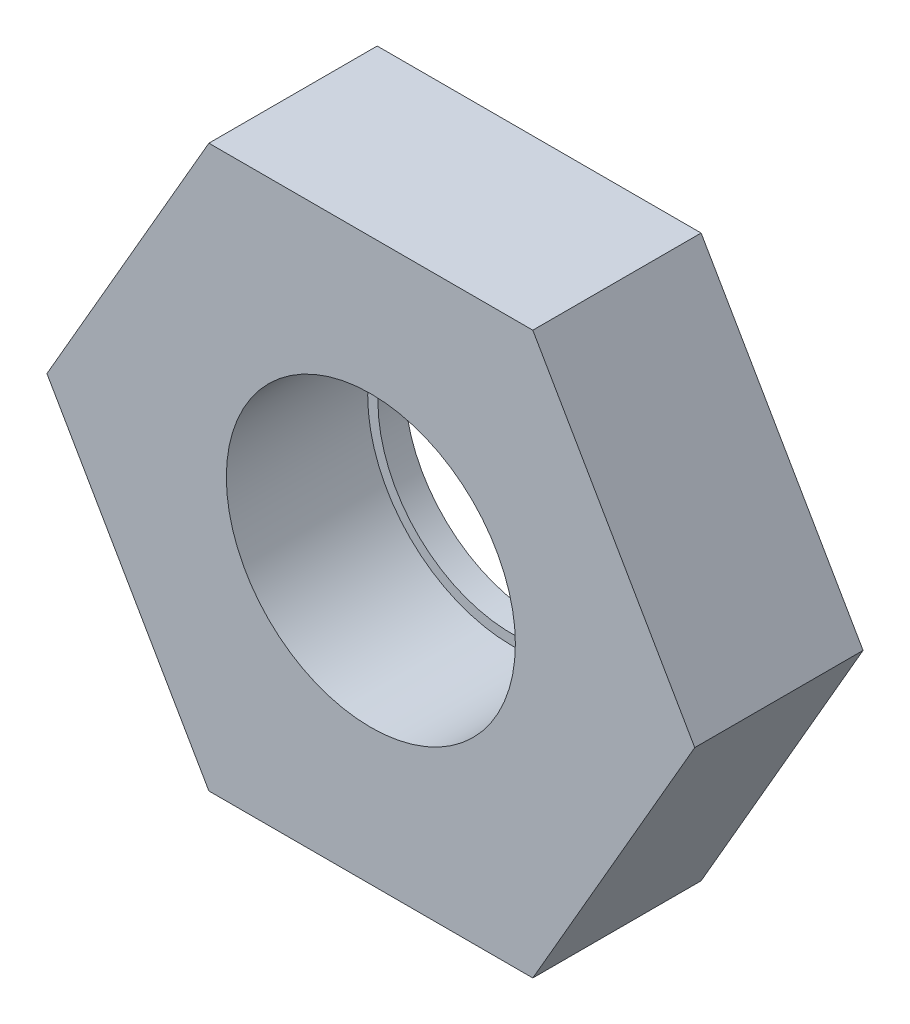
ISO-10303-21;
HEADER;
FILE_DESCRIPTION(('STEP AP214'),'2;1');
FILE_NAME('part.step','',(''),(''),'','','');
FILE_SCHEMA(('AUTOMOTIVE_DESIGN { 1 0 10303 214 1 1 1 1 }'));
ENDSEC;
DATA;
#1=APPLICATION_CONTEXT('core data for automotive mechanical design processes');
#2=APPLICATION_PROTOCOL_DEFINITION('international standard','automotive_design',2000,#1);
#3=PRODUCT_CONTEXT('',#1,'mechanical');
#4=PRODUCT('Part','Part','',(#3));
#5=PRODUCT_RELATED_PRODUCT_CATEGORY('part','',(#4));
#6=PRODUCT_DEFINITION_FORMATION('','',#4);
#7=PRODUCT_DEFINITION_CONTEXT('part definition',#1,'design');
#8=PRODUCT_DEFINITION('design','',#6,#7);
#9=PRODUCT_DEFINITION_SHAPE('','',#8);
#10=(LENGTH_UNIT() NAMED_UNIT(*) SI_UNIT(.MILLI.,.METRE.));
#11=(NAMED_UNIT(*) PLANE_ANGLE_UNIT() SI_UNIT($,.RADIAN.));
#12=(NAMED_UNIT(*) SI_UNIT($,.STERADIAN.) SOLID_ANGLE_UNIT());
#13=UNCERTAINTY_MEASURE_WITH_UNIT(LENGTH_MEASURE(1.E-05),#10,'distance_accuracy_value','');
#14=(GEOMETRIC_REPRESENTATION_CONTEXT(3) GLOBAL_UNCERTAINTY_ASSIGNED_CONTEXT((#13)) GLOBAL_UNIT_ASSIGNED_CONTEXT((#10,
#11,#12)) REPRESENTATION_CONTEXT('',''));
#15=CARTESIAN_POINT('',(0.,0.,0.));
#16=DIRECTION('',(0.,0.,1.));
#17=DIRECTION('',(1.,0.,0.));
#18=AXIS2_PLACEMENT_3D('',#15,#16,#17);
#19=CARTESIAN_POINT('',(13.748153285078,7.9375,4.7625));
#20=DIRECTION('',(0.,0.,1.));
#21=DIRECTION('',(1.,0.,0.));
#22=AXIS2_PLACEMENT_3D('',#19,#20,#21);
#23=PLANE('',#22);
#24=DIRECTION('',(0.5,0.86602540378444,0.));
#25=VECTOR('',#24,1.);
#26=CARTESIAN_POINT('',(4.58271776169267,-7.9375,4.7625));
#27=LINE('',#26,#25);
#28=CARTESIAN_POINT('',(4.58271776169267,-7.9375,4.7625));
#29=VERTEX_POINT('',#28);
#30=CARTESIAN_POINT('',(9.16543552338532,0.,4.7625));
#31=VERTEX_POINT('',#30);
#32=EDGE_CURVE('E100',#29,#31,#27,.T.);
#33=ORIENTED_EDGE('',*,*,#32,.T.);
#34=DIRECTION('',(-0.5,0.86602540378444,0.));
#35=VECTOR('',#34,1.);
#36=CARTESIAN_POINT('',(9.16543552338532,0.,4.7625));
#37=LINE('',#36,#35);
#38=CARTESIAN_POINT('',(4.58271776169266,7.9375,4.7625));
#39=VERTEX_POINT('',#38);
#40=EDGE_CURVE('E82',#31,#39,#37,.T.);
#41=ORIENTED_EDGE('',*,*,#40,.T.);
#42=DIRECTION('',(-1.,0.,0.));
#43=VECTOR('',#42,1.);
#44=CARTESIAN_POINT('',(4.58271776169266,7.9375,4.7625));
#45=LINE('',#44,#43);
#46=CARTESIAN_POINT('',(-4.58271776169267,7.9375,4.7625));
#47=VERTEX_POINT('',#46);
#48=EDGE_CURVE('E103',#39,#47,#45,.T.);
#49=ORIENTED_EDGE('',*,*,#48,.T.);
#50=DIRECTION('',(-0.5,-0.86602540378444,0.));
#51=VECTOR('',#50,1.);
#52=CARTESIAN_POINT('',(-4.58271776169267,7.9375,4.7625));
#53=LINE('',#52,#51);
#54=CARTESIAN_POINT('',(-9.16543552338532,0.,4.7625));
#55=VERTEX_POINT('',#54);
#56=EDGE_CURVE('E105',#47,#55,#53,.T.);
#57=ORIENTED_EDGE('',*,*,#56,.T.);
#58=DIRECTION('',(0.5,-0.86602540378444,0.));
#59=VECTOR('',#58,1.);
#60=CARTESIAN_POINT('',(-9.16543552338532,0.,4.7625));
#61=LINE('',#60,#59);
#62=CARTESIAN_POINT('',(-4.58271776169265,-7.9375,4.7625));
#63=VERTEX_POINT('',#62);
#64=EDGE_CURVE('E35',#55,#63,#61,.T.);
#65=ORIENTED_EDGE('',*,*,#64,.T.);
#66=DIRECTION('',(1.,0.,0.));
#67=VECTOR('',#66,1.);
#68=CARTESIAN_POINT('',(-4.58271776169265,-7.9375,4.7625));
#69=LINE('',#68,#67);
#70=EDGE_CURVE('E30',#63,#29,#69,.T.);
#71=ORIENTED_EDGE('',*,*,#70,.T.);
#72=EDGE_LOOP('',(#33,#41,#49,#57,#65,#71));
#73=FACE_BOUND('',#72,.T.);
#74=CARTESIAN_POINT('',(0.,0.,4.7625));
#75=DIRECTION('',(0.,0.,1.));
#76=DIRECTION('',(1.,0.,0.));
#77=AXIS2_PLACEMENT_3D('',#74,#75,#76);
#78=CIRCLE('',#77,4.0894);
#79=CARTESIAN_POINT('',(4.0894,0.,4.7625));
#80=VERTEX_POINT('',#79);
#81=EDGE_CURVE('E18',#80,#80,#78,.F.);
#82=ORIENTED_EDGE('',*,*,#81,.T.);
#83=EDGE_LOOP('',(#82));
#84=FACE_BOUND('',#83,.T.);
#85=ADVANCED_FACE('F14',(#73,#84),#23,.T.);
#86=CARTESIAN_POINT('',(13.748153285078,7.9375,0.));
#87=DIRECTION('',(0.,0.,1.));
#88=DIRECTION('',(1.,0.,0.));
#89=AXIS2_PLACEMENT_3D('',#86,#87,#88);
#90=PLANE('',#89);
#91=DIRECTION('',(0.5,0.86602540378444,0.));
#92=VECTOR('',#91,1.);
#93=CARTESIAN_POINT('',(4.58271776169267,-7.9375,0.));
#94=LINE('',#93,#92);
#95=CARTESIAN_POINT('',(4.58271776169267,-7.9375,0.));
#96=VERTEX_POINT('',#95);
#97=CARTESIAN_POINT('',(9.16543552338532,0.,0.));
#98=VERTEX_POINT('',#97);
#99=EDGE_CURVE('E73',#96,#98,#94,.T.);
#100=ORIENTED_EDGE('',*,*,#99,.F.);
#101=DIRECTION('',(1.,0.,0.));
#102=VECTOR('',#101,1.);
#103=CARTESIAN_POINT('',(-4.58271776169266,-7.9375,0.));
#104=LINE('',#103,#102);
#105=CARTESIAN_POINT('',(-4.58271776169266,-7.9375,0.));
#106=VERTEX_POINT('',#105);
#107=EDGE_CURVE('E98',#106,#96,#104,.T.);
#108=ORIENTED_EDGE('',*,*,#107,.F.);
#109=DIRECTION('',(0.5,-0.86602540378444,0.));
#110=VECTOR('',#109,1.);
#111=CARTESIAN_POINT('',(-9.16543552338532,0.,0.));
#112=LINE('',#111,#110);
#113=CARTESIAN_POINT('',(-9.16543552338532,0.,0.));
#114=VERTEX_POINT('',#113);
#115=EDGE_CURVE('E96',#114,#106,#112,.T.);
#116=ORIENTED_EDGE('',*,*,#115,.F.);
#117=DIRECTION('',(-0.5,-0.86602540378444,0.));
#118=VECTOR('',#117,1.);
#119=CARTESIAN_POINT('',(-4.58271776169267,7.9375,0.));
#120=LINE('',#119,#118);
#121=CARTESIAN_POINT('',(-4.58271776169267,7.9375,0.));
#122=VERTEX_POINT('',#121);
#123=EDGE_CURVE('E94',#122,#114,#120,.T.);
#124=ORIENTED_EDGE('',*,*,#123,.F.);
#125=DIRECTION('',(-1.,0.,0.));
#126=VECTOR('',#125,1.);
#127=CARTESIAN_POINT('',(4.58271776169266,7.9375,0.));
#128=LINE('',#127,#126);
#129=CARTESIAN_POINT('',(4.58271776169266,7.9375,0.));
#130=VERTEX_POINT('',#129);
#131=EDGE_CURVE('E75',#130,#122,#128,.T.);
#132=ORIENTED_EDGE('',*,*,#131,.F.);
#133=DIRECTION('',(-0.5,0.86602540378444,0.));
#134=VECTOR('',#133,1.);
#135=CARTESIAN_POINT('',(9.16543552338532,0.,0.));
#136=LINE('',#135,#134);
#137=EDGE_CURVE('E68',#98,#130,#136,.T.);
#138=ORIENTED_EDGE('',*,*,#137,.F.);
#139=EDGE_LOOP('',(#100,#108,#116,#124,#132,#138));
#140=FACE_BOUND('',#139,.T.);
#141=CARTESIAN_POINT('',(0.,0.,0.));
#142=DIRECTION('',(0.,0.,1.));
#143=DIRECTION('',(1.,0.,0.));
#144=AXIS2_PLACEMENT_3D('',#141,#142,#143);
#145=CIRCLE('',#144,3.8);
#146=CARTESIAN_POINT('',(3.8,0.,0.));
#147=VERTEX_POINT('',#146);
#148=EDGE_CURVE('E163',#147,#147,#145,.F.);
#149=ORIENTED_EDGE('',*,*,#148,.F.);
#150=EDGE_LOOP('',(#149));
#151=FACE_BOUND('',#150,.T.);
#152=ADVANCED_FACE('F69',(#140,#151),#90,.F.);
#153=CARTESIAN_POINT('',(4.58271776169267,-7.9375,4.7625));
#154=DIRECTION('',(-0.86602540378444,0.5,0.));
#155=DIRECTION('',(-0.5,-0.86602540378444,0.));
#156=AXIS2_PLACEMENT_3D('',#153,#154,#155);
#157=PLANE('',#156);
#158=ORIENTED_EDGE('',*,*,#99,.T.);
#159=DIRECTION('',(0.,0.,-1.));
#160=VECTOR('',#159,1.);
#161=CARTESIAN_POINT('',(9.16543552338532,0.,4.7625));
#162=LINE('',#161,#160);
#163=EDGE_CURVE('E9',#31,#98,#162,.T.);
#164=ORIENTED_EDGE('',*,*,#163,.F.);
#165=ORIENTED_EDGE('',*,*,#32,.F.);
#166=DIRECTION('',(0.,0.,-1.));
#167=VECTOR('',#166,1.);
#168=CARTESIAN_POINT('',(4.58271776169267,-7.9375,4.7625));
#169=LINE('',#168,#167);
#170=EDGE_CURVE('E86',#29,#96,#169,.T.);
#171=ORIENTED_EDGE('',*,*,#170,.T.);
#172=EDGE_LOOP('',(#158,#164,#165,#171));
#173=FACE_BOUND('',#172,.T.);
#174=ADVANCED_FACE('F16',(#173),#157,.F.);
#175=CARTESIAN_POINT('',(9.16543552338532,0.,4.7625));
#176=DIRECTION('',(-0.86602540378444,-0.5,0.));
#177=DIRECTION('',(0.5,-0.86602540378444,0.));
#178=AXIS2_PLACEMENT_3D('',#175,#176,#177);
#179=PLANE('',#178);
#180=ORIENTED_EDGE('',*,*,#137,.T.);
#181=DIRECTION('',(0.,0.,-1.));
#182=VECTOR('',#181,1.);
#183=CARTESIAN_POINT('',(4.58271776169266,7.9375,4.7625));
#184=LINE('',#183,#182);
#185=EDGE_CURVE('E23',#39,#130,#184,.T.);
#186=ORIENTED_EDGE('',*,*,#185,.F.);
#187=ORIENTED_EDGE('',*,*,#40,.F.);
#188=ORIENTED_EDGE('',*,*,#163,.T.);
#189=EDGE_LOOP('',(#180,#186,#187,#188));
#190=FACE_BOUND('',#189,.T.);
#191=ADVANCED_FACE('F81',(#190),#179,.F.);
#192=CARTESIAN_POINT('',(4.58271776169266,7.9375,4.7625));
#193=DIRECTION('',(0.,-1.,0.));
#194=DIRECTION('',(0.,0.,-1.));
#195=AXIS2_PLACEMENT_3D('',#192,#193,#194);
#196=PLANE('',#195);
#197=ORIENTED_EDGE('',*,*,#131,.T.);
#198=DIRECTION('',(0.,0.,-1.));
#199=VECTOR('',#198,1.);
#200=CARTESIAN_POINT('',(-4.58271776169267,7.9375,4.7625));
#201=LINE('',#200,#199);
#202=EDGE_CURVE('E116',#47,#122,#201,.T.);
#203=ORIENTED_EDGE('',*,*,#202,.F.);
#204=ORIENTED_EDGE('',*,*,#48,.F.);
#205=ORIENTED_EDGE('',*,*,#185,.T.);
#206=EDGE_LOOP('',(#197,#203,#204,#205));
#207=FACE_BOUND('',#206,.T.);
#208=ADVANCED_FACE('F121',(#207),#196,.F.);
#209=CARTESIAN_POINT('',(-4.58271776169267,7.9375,4.7625));
#210=DIRECTION('',(0.86602540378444,-0.5,0.));
#211=DIRECTION('',(0.5,0.86602540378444,0.));
#212=AXIS2_PLACEMENT_3D('',#209,#210,#211);
#213=PLANE('',#212);
#214=ORIENTED_EDGE('',*,*,#123,.T.);
#215=DIRECTION('',(0.,0.,-1.));
#216=VECTOR('',#215,1.);
#217=CARTESIAN_POINT('',(-9.16543552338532,0.,4.7625));
#218=LINE('',#217,#216);
#219=EDGE_CURVE('E113',#55,#114,#218,.T.);
#220=ORIENTED_EDGE('',*,*,#219,.F.);
#221=ORIENTED_EDGE('',*,*,#56,.F.);
#222=ORIENTED_EDGE('',*,*,#202,.T.);
#223=EDGE_LOOP('',(#214,#220,#221,#222));
#224=FACE_BOUND('',#223,.T.);
#225=ADVANCED_FACE('F127',(#224),#213,.F.);
#226=CARTESIAN_POINT('',(-9.16543552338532,0.,4.7625));
#227=DIRECTION('',(0.86602540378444,0.5,0.));
#228=DIRECTION('',(-0.5,0.86602540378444,0.));
#229=AXIS2_PLACEMENT_3D('',#226,#227,#228);
#230=PLANE('',#229);
#231=ORIENTED_EDGE('',*,*,#115,.T.);
#232=DIRECTION('',(0.,0.,-1.));
#233=VECTOR('',#232,1.);
#234=CARTESIAN_POINT('',(-4.58271776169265,-7.9375,4.7625));
#235=LINE('',#234,#233);
#236=EDGE_CURVE('E110',#63,#106,#235,.T.);
#237=ORIENTED_EDGE('',*,*,#236,.F.);
#238=ORIENTED_EDGE('',*,*,#64,.F.);
#239=ORIENTED_EDGE('',*,*,#219,.T.);
#240=EDGE_LOOP('',(#231,#237,#238,#239));
#241=FACE_BOUND('',#240,.T.);
#242=ADVANCED_FACE('F130',(#241),#230,.F.);
#243=CARTESIAN_POINT('',(-4.58271776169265,-7.9375,4.7625));
#244=DIRECTION('',(0.,1.,0.));
#245=DIRECTION('',(0.,0.,1.));
#246=AXIS2_PLACEMENT_3D('',#243,#244,#245);
#247=PLANE('',#246);
#248=ORIENTED_EDGE('',*,*,#107,.T.);
#249=ORIENTED_EDGE('',*,*,#170,.F.);
#250=ORIENTED_EDGE('',*,*,#70,.F.);
#251=ORIENTED_EDGE('',*,*,#236,.T.);
#252=EDGE_LOOP('',(#248,#249,#250,#251));
#253=FACE_BOUND('',#252,.T.);
#254=ADVANCED_FACE('F132',(#253),#247,.F.);
#255=CARTESIAN_POINT('',(4.0894,0.,0.762));
#256=DIRECTION('',(0.,0.,1.));
#257=DIRECTION('',(1.,0.,0.));
#258=AXIS2_PLACEMENT_3D('',#255,#256,#257);
#259=PLANE('',#258);
#260=CARTESIAN_POINT('',(0.,0.,0.762));
#261=DIRECTION('',(0.,0.,-1.));
#262=DIRECTION('',(-1.,0.,0.));
#263=AXIS2_PLACEMENT_3D('',#260,#261,#262);
#264=CIRCLE('',#263,4.0894);
#265=CARTESIAN_POINT('',(-4.0894,0.,0.762000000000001));
#266=VERTEX_POINT('',#265);
#267=EDGE_CURVE('E89',#266,#266,#264,.T.);
#268=ORIENTED_EDGE('',*,*,#267,.F.);
#269=EDGE_LOOP('',(#268));
#270=FACE_BOUND('',#269,.T.);
#271=CARTESIAN_POINT('',(0.,0.,0.762));
#272=DIRECTION('',(0.,0.,1.));
#273=DIRECTION('',(1.,0.,0.));
#274=AXIS2_PLACEMENT_3D('',#271,#272,#273);
#275=CIRCLE('',#274,3.8);
#276=CARTESIAN_POINT('',(3.8,0.,0.762));
#277=VERTEX_POINT('',#276);
#278=EDGE_CURVE('E166',#277,#277,#275,.T.);
#279=ORIENTED_EDGE('',*,*,#278,.F.);
#280=EDGE_LOOP('',(#279));
#281=FACE_BOUND('',#280,.T.);
#282=ADVANCED_FACE('F134',(#270,#281),#259,.T.);
#283=CARTESIAN_POINT('',(0.,0.,-2.74796771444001));
#284=DIRECTION('',(0.,0.,-1.));
#285=DIRECTION('',(-1.,0.,0.));
#286=AXIS2_PLACEMENT_3D('',#283,#284,#285);
#287=CYLINDRICAL_SURFACE('',#286,4.0894);
#288=ORIENTED_EDGE('',*,*,#81,.F.);
#289=EDGE_LOOP('',(#288));
#290=FACE_BOUND('',#289,.T.);
#291=ORIENTED_EDGE('',*,*,#267,.T.);
#292=EDGE_LOOP('',(#291));
#293=FACE_BOUND('',#292,.T.);
#294=ADVANCED_FACE('F141',(#290,#293),#287,.F.);
#295=CARTESIAN_POINT('',(0.,0.,-11.5665698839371));
#296=DIRECTION('',(0.,0.,1.));
#297=DIRECTION('',(1.,0.,0.));
#298=AXIS2_PLACEMENT_3D('',#295,#296,#297);
#299=CYLINDRICAL_SURFACE('',#298,3.8);
#300=ORIENTED_EDGE('',*,*,#148,.T.);
#301=EDGE_LOOP('',(#300));
#302=FACE_BOUND('',#301,.T.);
#303=ORIENTED_EDGE('',*,*,#278,.T.);
#304=EDGE_LOOP('',(#303));
#305=FACE_BOUND('',#304,.T.);
#306=ADVANCED_FACE('F154',(#302,#305),#299,.F.);
#307=CLOSED_SHELL('',(#85,#152,#174,#191,#208,#225,#242,#254,#282,#294,#306));
#308=MANIFOLD_SOLID_BREP('B1',#307);
#309=ADVANCED_BREP_SHAPE_REPRESENTATION('',(#18,#308),#14);
#310=SHAPE_DEFINITION_REPRESENTATION(#9,#309);
ENDSEC;
END-ISO-10303-21;
